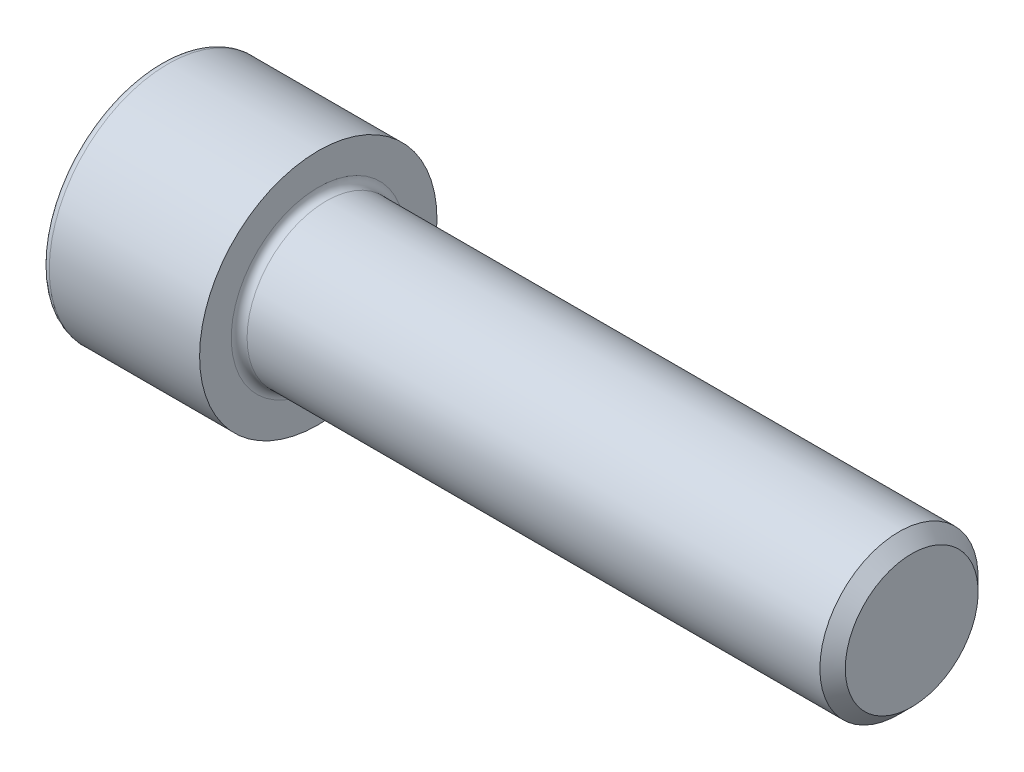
from build123d import *

# Parameters (mm, degrees)
FILLET1_R   = 0.6
FILLET2_R   = 0.6
HEX_2_DEPTH = 6


with BuildPart() as part:
    # BodySke → Base-Revolve (revolve)
    with BuildSketch(Plane.XY, mode=Mode.PRIVATE) as base_revolve_sk:
        Polygon((0, 0), (0, 9), (12, 9), (12, 6), (56.036, 6), (57, 5.036), (57, 0), align=None)
    revolve(base_revolve_sk.sketch.rotate(Axis((-31.75, 0, 0), (1, 0, 0)), 90), axis=Axis((-31.75, 0, 0), (1, 0, 0)))

    # Fillet1
    fillet1_edges = [part.edges().sort_by_distance(p)[0] for p in [
        (12, 0, -6),
    ]]
    fillet(fillet1_edges, radius=FILLET1_R)

    # Fillet2
    fillet2_edges = [part.edges().sort_by_distance(p)[0] for p in [
        (0, 0, -9),
    ]]
    fillet(fillet2_edges, radius=FILLET2_R)

    # Sketch2 → Hex-PreBroach (revolve, cut)
    with BuildSketch(Plane.XY, mode=Mode.PRIVATE) as hex_prebroach_sk:
        Polygon((0, 5.0575), (6, 5.0575), (8.919948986, 0), (0, 0), align=None)
    revolve(hex_prebroach_sk.sketch.rotate(Axis((0, 0, 0), (1, 0, 0)), 90), axis=Axis((0, 0, 0), (1, 0, 0)), mode=Mode.SUBTRACT)

    # Sketch3 → Hex 2 (cut)
    with BuildSketch(Plane(origin=(0, 0, 0), x_dir=(0, 0.500000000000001, 0.866025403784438), z_dir=(-1, 0, 0))):
        Polygon((2.919948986, 5.0575), (-2.919948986, 5.0575), (-5.839897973, 0), (-2.919948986, -5.0575), (2.919948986, -5.0575), (5.839897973, 0), align=None)
    extrude(amount=-HEX_2_DEPTH, mode=Mode.SUBTRACT)


solid = part.part
